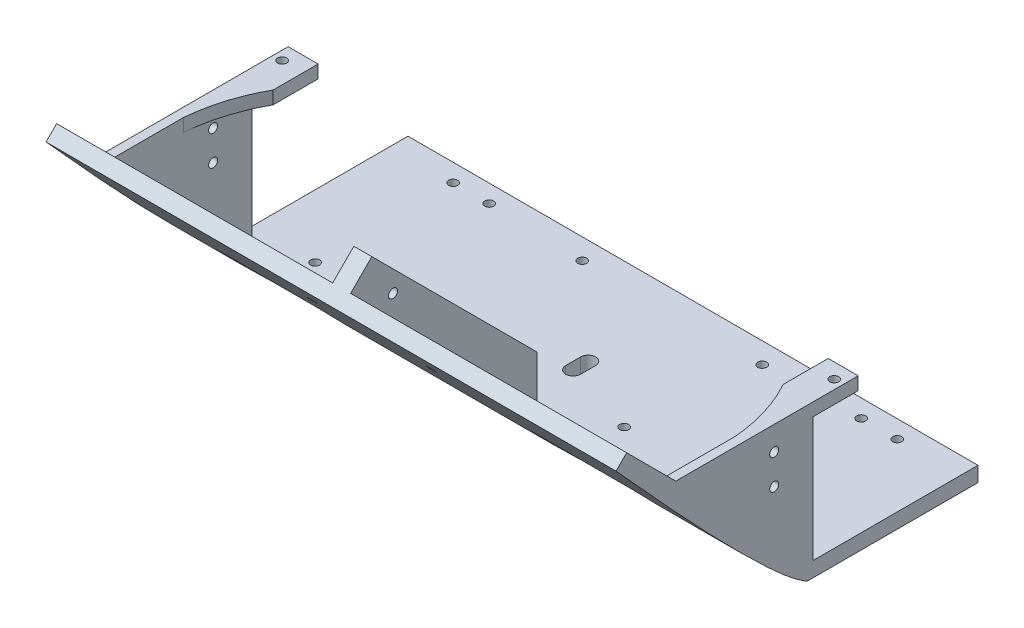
from build123d import *

# Parameters (mm, degrees)
EXTRUDE_1_DEPTH      = 190
SKETCH_2_W           = 35
SKETCH_2_H           = 35
CUT_EXTRUDE_1_DEPTH  = 150
EXTRUDE_2_DEPTH      = 3
EXTRUDE_3_DEPTH      = 3
SKETCH_5_W           = 10
SKETCH_5_H           = 4.3
EXTRUDE_4_DEPTH      = 15
EXTRUDE_5_DEPTH      = 4.3
SKETCH_7_R           = 1.5
CUT_EXTRUDE_2_DEPTH  = 25
SKETCH_9_W           = 6
SKETCH_9_H           = 87.928932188
EXTRUDE_6_DEPTH      = 10
CUT_EXTRUDE_3_DEPTH  = 6
SKETCH_12_R          = 1.5
CUT_EXTRUDE_5_DEPTH  = 10
SKETCH_13_R          = 1.5
CUT_EXTRUDE_6_DEPTH  = 10
SKETCH_14_R          = 1.5
CUT_EXTRUDE_7_DEPTH  = 10
SKETCH_15_R          = 1.5
CUT_EXTRUDE_8_DEPTH  = 10
SKETCH_16_W          = 190
SKETCH_16_H          = 5
EXTRUDE_7_DEPTH      = 12
SKETCH_11_R          = 1.5
CUT_EXTRUDE_9_DEPTH  = 10
SKETCH_17_R          = 1.5
CUT_EXTRUDE_10_DEPTH = 10
CUT_EXTRUDE_11_DEPTH = 10
SKETCH_19_R          = 1.5
CUT_EXTRUDE_12_DEPTH = 10


with BuildPart() as part:
    # Sketch 1 → Extrude 1 (new body)
    with BuildSketch(Plane(origin=(0, 0, 0), x_dir=(0, 0, -1), z_dir=(1, 0, 0))):
        with BuildLine():
            Line((0, 0), (-45, 0))
            add(Edge.make_bspline(
                [(-108.639610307, 63.639610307), (-92.684654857, 46.008872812), (-70.089598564, 21.026929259), (-49.591911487, 2.840865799), (-45, 0)],
                knots=[0, 0, 0, 0, 0.808693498, 1, 1, 1, 1], degree=3))
            Line((-108.639610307, 63.639610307), (-105.104076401, 67.175144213))
            Line((-105.104076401, 67.175144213), (-42.928932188, 5))
            Line((-42.928932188, 5), (0, 5))
            Line((0, 5), (0, 0))
        make_face()
    extrude(amount=EXTRUDE_1_DEPTH)

    # Sketch 2 → Cut-Extrude 1 (cut)
    with BuildSketch(Plane(origin=(0, -18.964466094, 18.964466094), x_dir=(-1, 0, 0), z_dir=(0, 0.7071067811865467, -0.7071067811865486))):
        with Locations((-43, 59.087850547)):
            Rectangle(SKETCH_2_W, SKETCH_2_H)
        with Locations((-147, 59.087850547)):
            Rectangle(SKETCH_2_W, SKETCH_2_H)
    extrude(amount=-CUT_EXTRUDE_1_DEPTH, mode=Mode.SUBTRACT)

    # Sketch 3 → Extrude 2 (add)
    with BuildSketch(Plane.ZY):
        Polygon((42.928932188, 5), (42.928932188, 50.8), (88.728932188, 50.8), align=None)
    extrude(amount=-EXTRUDE_2_DEPTH)

    # Sketch 4 → Extrude 3 (add)
    with BuildSketch(Plane(origin=(190, 0, 0), x_dir=(0, 0, -1), z_dir=(1, 0, 0))):
        Polygon((-42.928932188, 5), (-42.928932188, 50.8), (-88.728932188, 50.8), align=None)
    extrude(amount=-EXTRUDE_3_DEPTH)

    # Sketch 5 → Extrude 4 (add)
    with BuildSketch(Plane(origin=(0, 0, 42.928932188), x_dir=(-1, 0, 0), z_dir=(0, 0, -1))):
        with Locations((-185, 48.65)):
            Rectangle(SKETCH_5_W, SKETCH_5_H)
        with Locations((-5, 48.65)):
            Rectangle(SKETCH_5_W, SKETCH_5_H)
    extrude(amount=EXTRUDE_4_DEPTH)

    # Sketch 6 → Extrude 5 (add)
    with BuildSketch(Plane(origin=(0, 50.8, 0), x_dir=(1, 0, 0), z_dir=(0, 1, 0))):
        with BuildLine():
            Line((180, -42.928932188), (187, -42.928932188))
            Line((187, -42.928932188), (187, -65.828932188))
            add(Edge.make_bspline(
                [(180, -42.928932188), (185.906292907, -53.565251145), (187, -65.828932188)],
                knots=[0, 0, 0, 1, 1, 1], degree=2))
        make_face()
        with BuildLine():
            Line((3, -42.928932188), (3, -65.828932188))
            add(Edge.make_bspline(
                [(10, -42.928932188), (4.093707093, -53.565251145), (3, -65.828932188)],
                knots=[0, 0, 0, 1, 1, 1], degree=2))
            Line((10, -42.928932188), (3, -42.928932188))
        make_face()
    extrude(amount=-EXTRUDE_5_DEPTH)

    # Sketch 7 → Cut-Extrude 2 (cut)
    with BuildSketch(Plane(origin=(0, -18.964466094, 18.964466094), x_dir=(-1, 0, 0), z_dir=(0, 0.7071067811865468, -0.7071067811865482))):
        with Locations(Location((-75, 101.661854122, 0), (0, 0, 90))):
            Circle(SKETCH_7_R)
        with Locations(Location((-115, 101.661854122, 0), (0, 0, 90))):
            Circle(SKETCH_7_R)
    extrude(amount=-CUT_EXTRUDE_2_DEPTH, mode=Mode.SUBTRACT)

    # Sketch 9 → Extrude 6 (add)
    with BuildSketch(Plane(origin=(0, -18.964466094, 18.964466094), x_dir=(-1, 0, 0), z_dir=(0, 0.7071067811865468, -0.7071067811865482))):
        with Locations((-95, 77.855339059)):
            Rectangle(SKETCH_9_W, SKETCH_9_H)
    extrude(amount=EXTRUDE_6_DEPTH)

    # Sketch 10 → Cut-Extrude 3 (cut)
    with BuildSketch(Plane.ZY.offset(-92)):
        Polygon((42.928932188, 5), (42.928932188, 25.75), (35.627793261, 25.75), (27.590228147, 13.10387073), (28.777199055, 5), align=None)
    extrude(amount=-CUT_EXTRUDE_3_DEPTH, mode=Mode.SUBTRACT)

    # Sketch 12 → Cut-Extrude 5 (cut)
    with BuildSketch(Plane(origin=(0, 50.8, 0), x_dir=(1, 0, 0), z_dir=(0, 1, 0))):
        with Locations(Location((3, -32.928932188, 0), (0, 0, 270))):
            Circle(SKETCH_12_R)
        with Locations(Location((187, -32.928932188, 0), (0, 0, 270))):
            Circle(SKETCH_12_R)
    extrude(amount=-CUT_EXTRUDE_5_DEPTH, mode=Mode.SUBTRACT)

    # Sketch 13 → Cut-Extrude 6 (cut)
    with BuildSketch(Plane(origin=(0, 5, 0), x_dir=(1, 0, 0), z_dir=(0, 1, 0))):
        with Locations(Location((70, -35.928932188, 0), (0, 0, 270))):
            Circle(SKETCH_13_R)
        with Locations(Location((120, -35.928932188, 0), (0, 0, 270))):
            Circle(SKETCH_13_R)
    extrude(amount=-CUT_EXTRUDE_6_DEPTH, mode=Mode.SUBTRACT)

    # Sketch 14 → Cut-Extrude 7 (cut)
    with BuildSketch(Plane.ZY):
        with Locations((55.928932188, 42.8)):
            Circle(SKETCH_14_R)
        with Locations((55.928932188, 32.8)):
            Circle(SKETCH_14_R)
    extrude(amount=-CUT_EXTRUDE_7_DEPTH, mode=Mode.SUBTRACT)

    # Sketch 15 → Cut-Extrude 8 (cut)
    with BuildSketch(Plane.ZY.offset(-187)):
        with Locations((55.928932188, 32.8)):
            Circle(SKETCH_15_R)
        with Locations((55.928932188, 42.8)):
            Circle(SKETCH_15_R)
    extrude(amount=-CUT_EXTRUDE_8_DEPTH, mode=Mode.SUBTRACT)

    # Sketch 16 → Extrude 7 (add)
    with BuildSketch(Plane(origin=(0, 0, 0), x_dir=(-1, 0, 0), z_dir=(0, 0, -1))):
        with Locations((-95, 2.5)):
            Rectangle(SKETCH_16_W, SKETCH_16_H)
    extrude(amount=EXTRUDE_7_DEPTH)

    # Sketch 11 → Cut-Extrude 9 (cut)
    with BuildSketch(Plane(origin=(0, 5, 0), x_dir=(1, 0, 0), z_dir=(0, 1, 0))):
        with Locations(Location((21, -39.928932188, 0), (0, 0, 270))):
            Circle(SKETCH_11_R)
        with Locations(Location((21, 6.071067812, 0), (0, 0, 270))):
            Circle(SKETCH_11_R)
        with Locations(Location((33, 6.071067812, 0), (0, 0, 270))):
            Circle(SKETCH_11_R)
        with Locations(Location((157, 6.071067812, 0), (0, 0, 270))):
            Circle(SKETCH_11_R)
        with Locations(Location((169, 6.071067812, 0), (0, 0, 270))):
            Circle(SKETCH_11_R)
        with Locations(Location((169, -39.928932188, 0), (0, 0, 270))):
            Circle(SKETCH_11_R)
    extrude(amount=-CUT_EXTRUDE_9_DEPTH, mode=Mode.SUBTRACT)

    # Sketch 17 → Cut-Extrude 10 (cut)
    with BuildSketch(Plane(origin=(0, 5, 0), x_dir=(1, 0, 0), z_dir=(0, 1, 0))):
        with Locations(Location((65, 5.071067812, 0), (0, 0, 270))):
            Circle(SKETCH_17_R)
        with Locations(Location((125, 5.071067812, 0), (0, 0, 270))):
            Circle(SKETCH_17_R)
    extrude(amount=-CUT_EXTRUDE_10_DEPTH, mode=Mode.SUBTRACT)

    # Sketch 18 → Cut-Extrude 11 (cut)
    with BuildSketch(Plane(origin=(0, 5, 0), x_dir=(1, 0, 0), z_dir=(0, 1, 0))):
        with BuildLine():
            Line((97.5, -22.928932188), (97.5, -27.928932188))
            ThreePointArc((97.5, -27.928932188), (95, -30.428932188), (92.5, -27.928932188))
            Line((92.5, -27.928932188), (92.5, -22.928932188))
            ThreePointArc((92.5, -22.928932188), (95, -20.428932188), (97.5, -22.928932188))
        make_face()
    extrude(amount=-CUT_EXTRUDE_11_DEPTH, mode=Mode.SUBTRACT)

    # Sketch 19 → Cut-Extrude 12 (cut)
    with BuildSketch(Plane.ZY.offset(-92)):
        with Locations((90.961940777, 60.104076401)):
            Circle(SKETCH_19_R)
    extrude(amount=-CUT_EXTRUDE_12_DEPTH, mode=Mode.SUBTRACT)


solid = part.part
